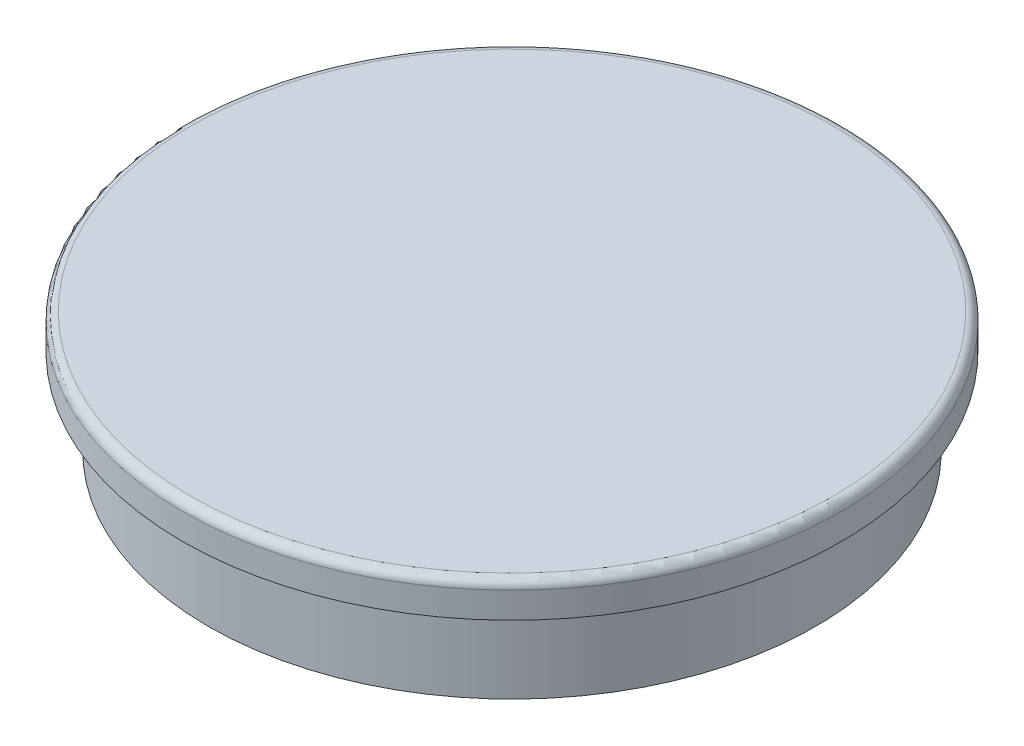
from build123d import *

# Parameters (mm, degrees)
SKIZZE1_R                       = 17.5
AUFSATZ_LINEAR_AUSTRAGEN1_DEPTH = 5
SKIZZE2_R                       = 19
AUFSATZ_LINEAR_AUSTRAGEN2_DEPTH = 2
VERRUNDUNG1_R                   = 0.5


with BuildPart() as part:
    # Skizze1 → Aufsatz-Linear austragen1 (new body)
    with BuildSketch(Plane(origin=(0, 0, 0), x_dir=(1, 0, 0), z_dir=(0, 1, 0))):
        with Locations(Location((0, 0, 0), (0, 0, 270))):
            Circle(SKIZZE1_R)
    extrude(amount=AUFSATZ_LINEAR_AUSTRAGEN1_DEPTH)

    # Skizze2 → Aufsatz-Linear austragen2 (add)
    with BuildSketch(Plane(origin=(0, 5, 0), x_dir=(1, 0, 0), z_dir=(0, 1, 0))):
        with Locations(Location((0, 0, 0), (0, 0, 270))):
            Circle(SKIZZE2_R)
    extrude(amount=AUFSATZ_LINEAR_AUSTRAGEN2_DEPTH)

    # Verrundung1
    verrundung1_edges = [part.edges().sort_by_distance(p)[0] for p in [
        (0, 7, -19),
    ]]
    fillet(verrundung1_edges, radius=VERRUNDUNG1_R)


solid = part.part
